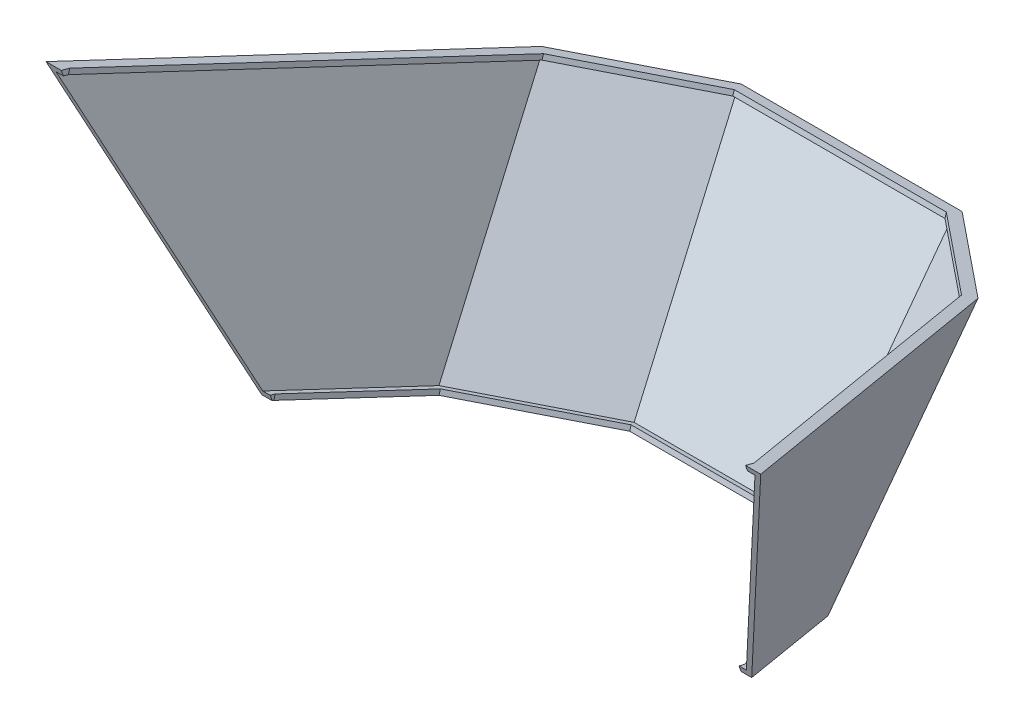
ISO-10303-21;
HEADER;
FILE_DESCRIPTION(('STEP AP214'),'2;1');
FILE_NAME('part.step','',(''),(''),'','','');
FILE_SCHEMA(('AUTOMOTIVE_DESIGN { 1 0 10303 214 1 1 1 1 }'));
ENDSEC;
DATA;
#1=APPLICATION_CONTEXT('core data for automotive mechanical design processes');
#2=APPLICATION_PROTOCOL_DEFINITION('international standard','automotive_design',2000,#1);
#3=PRODUCT_CONTEXT('',#1,'mechanical');
#4=PRODUCT('Part','Part','',(#3));
#5=PRODUCT_RELATED_PRODUCT_CATEGORY('part','',(#4));
#6=PRODUCT_DEFINITION_FORMATION('','',#4);
#7=PRODUCT_DEFINITION_CONTEXT('part definition',#1,'design');
#8=PRODUCT_DEFINITION('design','',#6,#7);
#9=PRODUCT_DEFINITION_SHAPE('','',#8);
#10=(LENGTH_UNIT() NAMED_UNIT(*) SI_UNIT(.MILLI.,.METRE.));
#11=(NAMED_UNIT(*) PLANE_ANGLE_UNIT() SI_UNIT($,.RADIAN.));
#12=(NAMED_UNIT(*) SI_UNIT($,.STERADIAN.) SOLID_ANGLE_UNIT());
#13=UNCERTAINTY_MEASURE_WITH_UNIT(LENGTH_MEASURE(1.E-05),#10,'distance_accuracy_value','');
#14=(GEOMETRIC_REPRESENTATION_CONTEXT(3) GLOBAL_UNCERTAINTY_ASSIGNED_CONTEXT((#13)) GLOBAL_UNIT_ASSIGNED_CONTEXT((#10,
#11,#12)) REPRESENTATION_CONTEXT('',''));
#15=CARTESIAN_POINT('',(0.,0.,0.));
#16=DIRECTION('',(0.,0.,1.));
#17=DIRECTION('',(1.,0.,0.));
#18=AXIS2_PLACEMENT_3D('',#15,#16,#17);
#19=CARTESIAN_POINT('',(87.7094880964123,205.750801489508,-511.611203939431));
#20=DIRECTION('',(-1.,0.,0.));
#21=DIRECTION('',(0.,0.,1.));
#22=AXIS2_PLACEMENT_3D('',#19,#20,#21);
#23=PLANE('',#22);
#24=DIRECTION('',(0.,0.939692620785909,0.342020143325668));
#25=VECTOR('',#24,1.);
#26=CARTESIAN_POINT('',(87.7094880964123,206.872048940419,-514.691805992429));
#27=LINE('',#26,#25);
#28=CARTESIAN_POINT('',(87.7094880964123,212.7450582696,-512.554205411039));
#29=VERTEX_POINT('',#28);
#30=CARTESIAN_POINT('',(87.7094880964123,216.186516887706,-511.30161691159));
#31=VERTEX_POINT('',#30);
#32=EDGE_CURVE('E453',#29,#31,#27,.T.);
#33=ORIENTED_EDGE('',*,*,#32,.F.);
#34=DIRECTION('',(0.,0.258819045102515,0.96592582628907));
#35=VECTOR('',#34,1.);
#36=CARTESIAN_POINT('',(87.7094880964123,213.692937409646,-509.016672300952));
#37=LINE('',#36,#35);
#38=CARTESIAN_POINT('',(87.7094880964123,212.512282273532,-513.422937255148));
#39=VERTEX_POINT('',#38);
#40=EDGE_CURVE('E306',#39,#29,#37,.T.);
#41=ORIENTED_EDGE('',*,*,#40,.F.);
#42=DIRECTION('',(0.,0.96592582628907,-0.258819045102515));
#43=VECTOR('',#42,1.);
#44=CARTESIAN_POINT('',(87.7094880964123,205.750801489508,-511.611203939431));
#45=LINE('',#44,#43);
#46=CARTESIAN_POINT('',(87.7094880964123,215.410059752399,-514.199394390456));
#47=VERTEX_POINT('',#46);
#48=EDGE_CURVE('E293',#39,#47,#45,.T.);
#49=ORIENTED_EDGE('',*,*,#48,.T.);
#50=DIRECTION('',(0.,0.258819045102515,0.96592582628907));
#51=VECTOR('',#50,1.);
#52=CARTESIAN_POINT('',(87.7094880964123,215.410059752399,-514.199394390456));
#53=LINE('',#52,#51);
#54=EDGE_CURVE('E289',#47,#31,#53,.T.);
#55=ORIENTED_EDGE('',*,*,#54,.T.);
#56=EDGE_LOOP('',(#33,#41,#49,#55));
#57=FACE_BOUND('',#56,.T.);
#58=ADVANCED_FACE('F33',(#57),#23,.F.);
#59=CARTESIAN_POINT('',(362.290511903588,220.28562900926,-457.366489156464));
#60=DIRECTION('',(1.,0.,0.));
#61=DIRECTION('',(0.,0.,-1.));
#62=AXIS2_PLACEMENT_3D('',#59,#60,#61);
#63=PLANE('',#62);
#64=DIRECTION('',(0.,-0.939692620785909,-0.342020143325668));
#65=VECTOR('',#64,1.);
#66=CARTESIAN_POINT('',(362.290511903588,237.14053990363,-503.674976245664));
#67=LINE('',#66,#65);
#68=CARTESIAN_POINT('',(362.290511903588,216.186516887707,-511.301616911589));
#69=VERTEX_POINT('',#68);
#70=CARTESIAN_POINT('',(362.290511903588,212.7450582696,-512.554205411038));
#71=VERTEX_POINT('',#70);
#72=EDGE_CURVE('E447',#69,#71,#67,.T.);
#73=ORIENTED_EDGE('',*,*,#72,.F.);
#74=DIRECTION('',(0.,-0.258819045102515,-0.96592582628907));
#75=VECTOR('',#74,1.);
#76=CARTESIAN_POINT('',(362.290511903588,229.944887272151,-459.954679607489));
#77=LINE('',#76,#75);
#78=CARTESIAN_POINT('',(362.290511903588,215.410059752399,-514.199394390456));
#79=VERTEX_POINT('',#78);
#80=EDGE_CURVE('E265',#69,#79,#77,.T.);
#81=ORIENTED_EDGE('',*,*,#80,.T.);
#82=DIRECTION('',(0.,0.96592582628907,-0.258819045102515));
#83=VECTOR('',#82,1.);
#84=CARTESIAN_POINT('',(362.290511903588,205.750801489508,-511.611203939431));
#85=LINE('',#84,#83);
#86=CARTESIAN_POINT('',(362.290511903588,212.512282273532,-513.422937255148));
#87=VERTEX_POINT('',#86);
#88=EDGE_CURVE('E292',#87,#79,#85,.T.);
#89=ORIENTED_EDGE('',*,*,#88,.F.);
#90=DIRECTION('',(0.,-0.258819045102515,-0.96592582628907));
#91=VECTOR('',#90,1.);
#92=CARTESIAN_POINT('',(362.290511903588,213.692937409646,-509.016672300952));
#93=LINE('',#92,#91);
#94=EDGE_CURVE('E295',#71,#87,#93,.T.);
#95=ORIENTED_EDGE('',*,*,#94,.F.);
#96=EDGE_LOOP('',(#73,#81,#89,#95));
#97=FACE_BOUND('',#96,.T.);
#98=ADVANCED_FACE('F504',(#97),#63,.F.);
#99=CARTESIAN_POINT('',(450.,213.692937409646,-509.016672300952));
#100=DIRECTION('',(0.,0.96592582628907,-0.258819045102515));
#101=DIRECTION('',(0.,0.258819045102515,0.96592582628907));
#102=AXIS2_PLACEMENT_3D('',#99,#100,#101);
#103=PLANE('',#102);
#104=DIRECTION('',(1.,0.,0.));
#105=VECTOR('',#104,1.);
#106=CARTESIAN_POINT('',(450.,212.7450582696,-512.554205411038));
#107=LINE('',#106,#105);
#108=CARTESIAN_POINT('',(81.4768604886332,212.7450582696,-512.55420541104));
#109=VERTEX_POINT('',#108);
#110=EDGE_CURVE('E255',#109,#29,#107,.T.);
#111=ORIENTED_EDGE('',*,*,#110,.F.);
#112=DIRECTION('',(-0.352911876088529,0.242165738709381,0.90377484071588));
#113=VECTOR('',#112,1.);
#114=CARTESIAN_POINT('',(126.165920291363,182.079728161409,-626.998775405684));
#115=LINE('',#114,#113);
#116=CARTESIAN_POINT('',(110.068113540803,193.125934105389,-585.77377359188));
#117=VERTEX_POINT('',#116);
#118=EDGE_CURVE('E339',#117,#109,#115,.T.);
#119=ORIENTED_EDGE('',*,*,#118,.F.);
#120=DIRECTION('',(-0.749794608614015,0.171252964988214,0.639124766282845));
#121=VECTOR('',#120,1.);
#122=CARTESIAN_POINT('',(261.751241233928,158.481532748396,-715.06843965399));
#123=LINE('',#122,#121);
#124=CARTESIAN_POINT('',(173.168846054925,178.713737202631,-639.56082468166));
#125=VERTEX_POINT('',#124);
#126=EDGE_CURVE('E337',#125,#117,#123,.T.);
#127=ORIENTED_EDGE('',*,*,#126,.F.);
#128=DIRECTION('',(-1.,0.,0.));
#129=VECTOR('',#128,1.);
#130=CARTESIAN_POINT('',(450.,178.713737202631,-639.56082468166));
#131=LINE('',#130,#129);
#132=CARTESIAN_POINT('',(276.831153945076,178.713737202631,-639.56082468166));
#133=VERTEX_POINT('',#132);
#134=EDGE_CURVE('E325',#133,#125,#131,.T.);
#135=ORIENTED_EDGE('',*,*,#134,.F.);
#136=DIRECTION('',(-0.749794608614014,-0.171252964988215,-0.639124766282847));
#137=VECTOR('',#136,1.);
#138=CARTESIAN_POINT('',(441.235138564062,216.263580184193,-499.422902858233));
#139=LINE('',#138,#137);
#140=CARTESIAN_POINT('',(339.931886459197,193.125934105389,-585.77377359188));
#141=VERTEX_POINT('',#140);
#142=EDGE_CURVE('E331',#141,#133,#139,.T.);
#143=ORIENTED_EDGE('',*,*,#142,.F.);
#144=DIRECTION('',(-0.352911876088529,-0.242165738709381,-0.90377484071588));
#145=VECTOR('',#144,1.);
#146=CARTESIAN_POINT('',(379.880136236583,220.53815248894,-483.46998183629));
#147=LINE('',#146,#145);
#148=CARTESIAN_POINT('',(368.523139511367,212.7450582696,-512.554205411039));
#149=VERTEX_POINT('',#148);
#150=EDGE_CURVE('E342',#149,#141,#147,.T.);
#151=ORIENTED_EDGE('',*,*,#150,.F.);
#152=EDGE_CURVE('E449',#71,#149,#107,.T.);
#153=ORIENTED_EDGE('',*,*,#152,.F.);
#154=ORIENTED_EDGE('',*,*,#94,.T.);
#155=DIRECTION('',(-0.352911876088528,-0.242165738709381,-0.903774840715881));
#156=VECTOR('',#155,1.);
#157=CARTESIAN_POINT('',(374.72074069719,221.04182106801,-481.590265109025));
#158=LINE('',#157,#156);
#159=CARTESIAN_POINT('',(335.110043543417,193.861229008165,-583.029615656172));
#160=VERTEX_POINT('',#159);
#161=EDGE_CURVE('E309',#87,#160,#158,.T.);
#162=ORIENTED_EDGE('',*,*,#161,.T.);
#163=DIRECTION('',(-0.749794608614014,-0.171252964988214,-0.639124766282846));
#164=VECTOR('',#163,1.);
#165=CARTESIAN_POINT('',(437.714647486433,217.296103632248,-495.569472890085));
#166=LINE('',#165,#164);
#167=CARTESIAN_POINT('',(274.798099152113,180.085990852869,-634.439504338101));
#168=VERTEX_POINT('',#167);
#169=EDGE_CURVE('E312',#160,#168,#166,.T.);
#170=ORIENTED_EDGE('',*,*,#169,.T.);
#171=DIRECTION('',(-1.,0.,0.));
#172=VECTOR('',#171,1.);
#173=CARTESIAN_POINT('',(450.,180.085990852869,-634.439504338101));
#174=LINE('',#173,#172);
#175=CARTESIAN_POINT('',(175.201900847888,180.085990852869,-634.439504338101));
#176=VERTEX_POINT('',#175);
#177=EDGE_CURVE('E315',#168,#176,#174,.T.);
#178=ORIENTED_EDGE('',*,*,#177,.T.);
#179=DIRECTION('',(-0.749794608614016,0.171252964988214,0.639124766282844));
#180=VECTOR('',#179,1.);
#181=CARTESIAN_POINT('',(265.271732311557,159.514056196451,-711.215009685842));
#182=LINE('',#181,#180);
#183=CARTESIAN_POINT('',(114.889956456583,193.861229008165,-583.029615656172));
#184=VERTEX_POINT('',#183);
#185=EDGE_CURVE('E318',#176,#184,#182,.T.);
#186=ORIENTED_EDGE('',*,*,#185,.T.);
#187=DIRECTION('',(-0.352911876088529,0.242165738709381,0.90377484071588));
#188=VECTOR('',#187,1.);
#189=CARTESIAN_POINT('',(131.325315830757,182.583396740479,-625.119058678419));
#190=LINE('',#189,#188);
#191=EDGE_CURVE('E321',#184,#39,#190,.T.);
#192=ORIENTED_EDGE('',*,*,#191,.T.);
#193=ORIENTED_EDGE('',*,*,#40,.T.);
#194=EDGE_LOOP('',(#111,#119,#127,#135,#143,#151,#153,#154,#162,#170,#178,#186,#192,#193));
#195=FACE_BOUND('',#194,.T.);
#196=ADVANCED_FACE('F470',(#195),#103,.F.);
#197=CARTESIAN_POINT('',(450.,303.358196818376,-734.618347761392));
#198=DIRECTION('',(0.,-0.96592582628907,0.258819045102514));
#199=DIRECTION('',(0.,-0.258819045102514,-0.96592582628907));
#200=AXIS2_PLACEMENT_3D('',#197,#198,#199);
#201=PLANE('',#200);
#202=DIRECTION('',(-1.,0.,0.));
#203=VECTOR('',#202,1.);
#204=CARTESIAN_POINT('',(449.999999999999,379.082224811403,-452.012427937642));
#205=LINE('',#204,#203);
#206=CARTESIAN_POINT('',(434.337984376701,379.082224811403,-452.012427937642));
#207=VERTEX_POINT('',#206);
#208=CARTESIAN_POINT('',(425.381983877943,379.082224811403,-452.012427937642));
#209=VERTEX_POINT('',#208);
#210=EDGE_CURVE('E257',#207,#209,#205,.T.);
#211=ORIENTED_EDGE('',*,*,#210,.F.);
#212=DIRECTION('',(0.352911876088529,0.24216573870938,0.90377484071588));
#213=VECTOR('',#212,1.);
#214=CARTESIAN_POINT('',(339.67905256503,314.127907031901,-694.425242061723));
#215=LINE('',#214,#213);
#216=CARTESIAN_POINT('',(352.797034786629,323.129377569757,-660.831296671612));
#217=VERTEX_POINT('',#216);
#218=EDGE_CURVE('E344',#217,#207,#215,.T.);
#219=ORIENTED_EDGE('',*,*,#218,.F.);
#220=DIRECTION('',(0.749794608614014,0.171252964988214,0.639124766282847));
#221=VECTOR('',#220,1.);
#222=CARTESIAN_POINT('',(369.545387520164,326.954698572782,-646.55500433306));
#223=LINE('',#222,#221);
#224=CARTESIAN_POINT('',(289.696302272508,308.717180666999,-714.618347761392));
#225=VERTEX_POINT('',#224);
#226=EDGE_CURVE('E93',#225,#217,#223,.T.);
#227=ORIENTED_EDGE('',*,*,#226,.F.);
#228=DIRECTION('',(1.,0.,0.));
#229=VECTOR('',#228,1.);
#230=CARTESIAN_POINT('',(450.,308.717180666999,-714.618347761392));
#231=LINE('',#230,#229);
#232=CARTESIAN_POINT('',(160.303697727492,308.717180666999,-714.618347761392));
#233=VERTEX_POINT('',#232);
#234=EDGE_CURVE('E86',#233,#225,#231,.T.);
#235=ORIENTED_EDGE('',*,*,#234,.F.);
#236=DIRECTION('',(0.749794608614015,-0.171252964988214,-0.639124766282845));
#237=VECTOR('',#236,1.);
#238=CARTESIAN_POINT('',(333.440992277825,269.172651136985,-862.200541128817));
#239=LINE('',#238,#237);
#240=CARTESIAN_POINT('',(97.2029652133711,323.129377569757,-660.831296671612));
#241=VERTEX_POINT('',#240);
#242=EDGE_CURVE('E334',#241,#233,#239,.T.);
#243=ORIENTED_EDGE('',*,*,#242,.F.);
#244=DIRECTION('',(0.352911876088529,-0.24216573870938,-0.90377484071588));
#245=VECTOR('',#244,1.);
#246=CARTESIAN_POINT('',(166.367003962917,275.66948270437,-837.954035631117));
#247=LINE('',#246,#245);
#248=CARTESIAN_POINT('',(15.6620156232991,379.082224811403,-452.012427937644));
#249=VERTEX_POINT('',#248);
#250=EDGE_CURVE('E254',#249,#241,#247,.T.);
#251=ORIENTED_EDGE('',*,*,#250,.F.);
#252=CARTESIAN_POINT('',(24.6180161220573,379.082224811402,-452.012427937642));
#253=VERTEX_POINT('',#252);
#254=EDGE_CURVE('E235',#253,#249,#205,.T.);
#255=ORIENTED_EDGE('',*,*,#254,.F.);
#256=DIRECTION('',(0.,-0.258819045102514,-0.96592582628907));
#257=VECTOR('',#256,1.);
#258=CARTESIAN_POINT('',(24.6180161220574,303.358196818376,-734.618347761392));
#259=LINE('',#258,#257);
#260=CARTESIAN_POINT('',(24.6180161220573,377.762086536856,-456.939251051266));
#261=VERTEX_POINT('',#260);
#262=EDGE_CURVE('E251',#253,#261,#259,.T.);
#263=ORIENTED_EDGE('',*,*,#262,.T.);
#264=DIRECTION('',(0.352911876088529,-0.24216573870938,-0.903774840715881));
#265=VECTOR('',#264,1.);
#266=CARTESIAN_POINT('',(172.523315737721,276.270471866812,-835.711113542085));
#267=LINE('',#266,#265);
#268=CARTESIAN_POINT('',(102.557159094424,324.280774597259,-656.534224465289));
#269=VERTEX_POINT('',#268);
#270=EDGE_CURVE('E358',#261,#269,#267,.T.);
#271=ORIENTED_EDGE('',*,*,#270,.T.);
#272=DIRECTION('',(0.749794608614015,-0.171252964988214,-0.639124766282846));
#273=VECTOR('',#272,1.);
#274=CARTESIAN_POINT('',(337.992155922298,270.507460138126,-857.218966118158));
#275=LINE('',#274,#273);
#276=CARTESIAN_POINT('',(162.869103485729,310.505536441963,-707.944113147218));
#277=VERTEX_POINT('',#276);
#278=EDGE_CURVE('E399',#269,#277,#275,.T.);
#279=ORIENTED_EDGE('',*,*,#278,.T.);
#280=DIRECTION('',(1.,0.,0.));
#281=VECTOR('',#280,1.);
#282=CARTESIAN_POINT('',(450.,310.505536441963,-707.944113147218));
#283=LINE('',#282,#281);
#284=CARTESIAN_POINT('',(287.130896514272,310.505536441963,-707.944113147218));
#285=VERTEX_POINT('',#284);
#286=EDGE_CURVE('E402',#277,#285,#283,.T.);
#287=ORIENTED_EDGE('',*,*,#286,.T.);
#288=DIRECTION('',(0.749794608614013,0.171252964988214,0.639124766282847));
#289=VECTOR('',#288,1.);
#290=CARTESIAN_POINT('',(364.994223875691,328.289507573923,-641.573429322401));
#291=LINE('',#290,#289);
#292=CARTESIAN_POINT('',(347.442840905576,324.280774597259,-656.534224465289));
#293=VERTEX_POINT('',#292);
#294=EDGE_CURVE('E42',#285,#293,#291,.T.);
#295=ORIENTED_EDGE('',*,*,#294,.T.);
#296=DIRECTION('',(0.352911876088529,0.24216573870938,0.903774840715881));
#297=VECTOR('',#296,1.);
#298=CARTESIAN_POINT('',(333.522740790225,314.728896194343,-692.182319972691));
#299=LINE('',#298,#297);
#300=CARTESIAN_POINT('',(425.381983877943,377.762086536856,-456.939251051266));
#301=VERTEX_POINT('',#300);
#302=EDGE_CURVE('E12',#293,#301,#299,.T.);
#303=ORIENTED_EDGE('',*,*,#302,.T.);
#304=DIRECTION('',(0.,0.258819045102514,0.96592582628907));
#305=VECTOR('',#304,1.);
#306=CARTESIAN_POINT('',(425.381983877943,303.358196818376,-734.618347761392));
#307=LINE('',#306,#305);
#308=EDGE_CURVE('E261',#301,#209,#307,.T.);
#309=ORIENTED_EDGE('',*,*,#308,.T.);
#310=EDGE_LOOP('',(#211,#219,#227,#235,#243,#251,#255,#263,#271,#279,#287,#295,#303,#309));
#311=FACE_BOUND('',#310,.T.);
#312=ADVANCED_FACE('F249',(#311),#201,.F.);
#313=CARTESIAN_POINT('',(399.15129229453,-112.139629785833,-125.815468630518));
#314=DIRECTION('',(0.921243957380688,-0.258819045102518,-0.290382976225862));
#315=DIRECTION('',(-0.300626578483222,0.,-0.953741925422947));
#316=AXIS2_PLACEMENT_3D('',#313,#314,#315);
#317=PLANE('',#316);
#318=ORIENTED_EDGE('',*,*,#218,.T.);
#319=DIRECTION('',(-0.348500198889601,-0.880782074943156,-0.320578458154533));
#320=VECTOR('',#319,1.);
#321=CARTESIAN_POINT('',(315.725852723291,79.3078207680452,-561.121388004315));
#322=LINE('',#321,#320);
#323=EDGE_CURVE('E450',#207,#149,#322,.T.);
#324=ORIENTED_EDGE('',*,*,#323,.T.);
#325=ORIENTED_EDGE('',*,*,#150,.T.);
#326=DIRECTION('',(0.0853889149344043,0.862862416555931,-0.498173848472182));
#327=VECTOR('',#326,1.);
#328=CARTESIAN_POINT('',(298.306096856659,-227.506292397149,-342.921644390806));
#329=LINE('',#328,#327);
#330=EDGE_CURVE('E351',#141,#217,#329,.T.);
#331=ORIENTED_EDGE('',*,*,#330,.T.);
#332=EDGE_LOOP('',(#318,#324,#325,#331));
#333=FACE_BOUND('',#332,.T.);
#334=ADVANCED_FACE('F463',(#333),#317,.T.);
#335=CARTESIAN_POINT('',(-17.2405992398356,-4.84366317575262,-5.43436565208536));
#336=DIRECTION('',(-0.921243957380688,-0.258819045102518,-0.290382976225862));
#337=DIRECTION('',(-0.300626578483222,0.,0.953741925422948));
#338=AXIS2_PLACEMENT_3D('',#335,#336,#337);
#339=PLANE('',#338);
#340=ORIENTED_EDGE('',*,*,#118,.T.);
#341=DIRECTION('',(-0.348500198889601,0.880782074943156,0.320578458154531));
#342=VECTOR('',#341,1.);
#343=CARTESIAN_POINT('',(79.6205723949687,217.436548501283,-510.846642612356));
#344=LINE('',#343,#342);
#345=EDGE_CURVE('E243',#109,#249,#344,.T.);
#346=ORIENTED_EDGE('',*,*,#345,.T.);
#347=ORIENTED_EDGE('',*,*,#250,.T.);
#348=DIRECTION('',(0.0853889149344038,-0.86286241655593,0.498173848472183));
#349=VECTOR('',#348,1.);
#350=CARTESIAN_POINT('',(148.412833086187,-194.350793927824,-362.063980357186));
#351=LINE('',#350,#349);
#352=EDGE_CURVE('E348',#241,#117,#351,.T.);
#353=ORIENTED_EDGE('',*,*,#352,.T.);
#354=EDGE_LOOP('',(#340,#346,#347,#353));
#355=FACE_BOUND('',#354,.T.);
#356=ADVANCED_FACE('F479',(#355),#339,.T.);
#357=CARTESIAN_POINT('',(425.381983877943,428.105569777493,-296.100736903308));
#358=DIRECTION('',(1.,0.,0.));
#359=DIRECTION('',(0.,0.,-1.));
#360=AXIS2_PLACEMENT_3D('',#357,#358,#359);
#361=PLANE('',#360);
#362=DIRECTION('',(0.,-0.939692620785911,-0.342020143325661));
#363=VECTOR('',#362,1.);
#364=CARTESIAN_POINT('',(425.381983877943,381.056164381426,-451.293972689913));
#365=LINE('',#364,#363);
#366=CARTESIAN_POINT('',(425.381983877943,375.640766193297,-453.265016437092));
#367=VERTEX_POINT('',#366);
#368=EDGE_CURVE('E244',#209,#367,#365,.T.);
#369=ORIENTED_EDGE('',*,*,#368,.F.);
#370=ORIENTED_EDGE('',*,*,#308,.F.);
#371=DIRECTION('',(0.,-0.96592582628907,0.258819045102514));
#372=VECTOR('',#371,1.);
#373=CARTESIAN_POINT('',(425.381983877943,384.52356732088,-458.750984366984));
#374=LINE('',#373,#372);
#375=CARTESIAN_POINT('',(425.381983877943,374.864309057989,-456.162793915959));
#376=VERTEX_POINT('',#375);
#377=EDGE_CURVE('E262',#301,#376,#374,.T.);
#378=ORIENTED_EDGE('',*,*,#377,.T.);
#379=DIRECTION('',(0.,0.258819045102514,0.96592582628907));
#380=VECTOR('',#379,1.);
#381=CARTESIAN_POINT('',(425.381983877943,418.446311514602,-293.512546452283));
#382=LINE('',#381,#380);
#383=EDGE_CURVE('E427',#376,#367,#382,.T.);
#384=ORIENTED_EDGE('',*,*,#383,.T.);
#385=EDGE_LOOP('',(#369,#370,#378,#384));
#386=FACE_BOUND('',#385,.T.);
#387=ADVANCED_FACE('F459',(#386),#361,.F.);
#388=CARTESIAN_POINT('',(24.6180161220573,384.52356732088,-458.750984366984));
#389=DIRECTION('',(-1.,0.,0.));
#390=DIRECTION('',(0.,0.,1.));
#391=AXIS2_PLACEMENT_3D('',#388,#389,#390);
#392=PLANE('',#391);
#393=DIRECTION('',(0.,0.939692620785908,0.34202014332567));
#394=VECTOR('',#393,1.);
#395=CARTESIAN_POINT('',(24.6180161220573,377.61470576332,-452.546561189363));
#396=LINE('',#395,#394);
#397=CARTESIAN_POINT('',(24.6180161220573,375.640766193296,-453.265016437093));
#398=VERTEX_POINT('',#397);
#399=EDGE_CURVE('E232',#398,#253,#396,.T.);
#400=ORIENTED_EDGE('',*,*,#399,.F.);
#401=DIRECTION('',(0.,-0.258819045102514,-0.96592582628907));
#402=VECTOR('',#401,1.);
#403=CARTESIAN_POINT('',(24.6180161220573,374.864309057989,-456.162793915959));
#404=LINE('',#403,#402);
#405=CARTESIAN_POINT('',(24.6180161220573,374.864309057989,-456.162793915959));
#406=VERTEX_POINT('',#405);
#407=EDGE_CURVE('E445',#398,#406,#404,.T.);
#408=ORIENTED_EDGE('',*,*,#407,.T.);
#409=DIRECTION('',(0.,-0.96592582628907,0.258819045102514));
#410=VECTOR('',#409,1.);
#411=CARTESIAN_POINT('',(24.6180161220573,384.52356732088,-458.750984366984));
#412=LINE('',#411,#410);
#413=EDGE_CURVE('E260',#261,#406,#412,.T.);
#414=ORIENTED_EDGE('',*,*,#413,.F.);
#415=ORIENTED_EDGE('',*,*,#262,.F.);
#416=EDGE_LOOP('',(#400,#408,#414,#415));
#417=FACE_BOUND('',#416,.T.);
#418=ADVANCED_FACE('F259',(#417),#392,.F.);
#419=CARTESIAN_POINT('',(450.,216.590714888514,-509.793129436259));
#420=DIRECTION('',(0.,0.96592582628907,-0.258819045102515));
#421=DIRECTION('',(0.,0.258819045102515,0.96592582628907));
#422=AXIS2_PLACEMENT_3D('',#419,#420,#421);
#423=PLANE('',#422);
#424=ORIENTED_EDGE('',*,*,#54,.F.);
#425=DIRECTION('',(-0.352911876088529,0.242165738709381,0.90377484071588));
#426=VECTOR('',#425,1.);
#427=CARTESIAN_POINT('',(114.889956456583,196.759006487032,-583.80607279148));
#428=LINE('',#427,#426);
#429=CARTESIAN_POINT('',(114.889956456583,196.759006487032,-583.80607279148));
#430=VERTEX_POINT('',#429);
#431=EDGE_CURVE('E286',#430,#47,#428,.T.);
#432=ORIENTED_EDGE('',*,*,#431,.F.);
#433=DIRECTION('',(-0.749794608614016,0.171252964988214,0.639124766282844));
#434=VECTOR('',#433,1.);
#435=CARTESIAN_POINT('',(175.201900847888,182.983768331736,-635.215961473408));
#436=LINE('',#435,#434);
#437=CARTESIAN_POINT('',(175.201900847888,182.983768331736,-635.215961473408));
#438=VERTEX_POINT('',#437);
#439=EDGE_CURVE('E283',#438,#430,#436,.T.);
#440=ORIENTED_EDGE('',*,*,#439,.F.);
#441=DIRECTION('',(-1.,0.,0.));
#442=VECTOR('',#441,1.);
#443=CARTESIAN_POINT('',(274.798099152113,182.983768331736,-635.215961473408));
#444=LINE('',#443,#442);
#445=CARTESIAN_POINT('',(274.798099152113,182.983768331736,-635.215961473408));
#446=VERTEX_POINT('',#445);
#447=EDGE_CURVE('E280',#446,#438,#444,.T.);
#448=ORIENTED_EDGE('',*,*,#447,.F.);
#449=DIRECTION('',(-0.749794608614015,-0.171252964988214,-0.639124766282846));
#450=VECTOR('',#449,1.);
#451=CARTESIAN_POINT('',(335.110043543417,196.759006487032,-583.80607279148));
#452=LINE('',#451,#450);
#453=CARTESIAN_POINT('',(335.110043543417,196.759006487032,-583.80607279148));
#454=VERTEX_POINT('',#453);
#455=EDGE_CURVE('E277',#454,#446,#452,.T.);
#456=ORIENTED_EDGE('',*,*,#455,.F.);
#457=DIRECTION('',(-0.352911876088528,-0.242165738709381,-0.90377484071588));
#458=VECTOR('',#457,1.);
#459=CARTESIAN_POINT('',(362.290511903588,215.410059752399,-514.199394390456));
#460=LINE('',#459,#458);
#461=EDGE_CURVE('E274',#79,#454,#460,.T.);
#462=ORIENTED_EDGE('',*,*,#461,.F.);
#463=ORIENTED_EDGE('',*,*,#80,.F.);
#464=DIRECTION('',(-1.,0.,0.));
#465=VECTOR('',#464,1.);
#466=CARTESIAN_POINT('',(450.,216.186516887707,-511.301616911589));
#467=LINE('',#466,#465);
#468=CARTESIAN_POINT('',(366.628359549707,216.186516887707,-511.301616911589));
#469=VERTEX_POINT('',#468);
#470=EDGE_CURVE('E396',#469,#69,#467,.T.);
#471=ORIENTED_EDGE('',*,*,#470,.F.);
#472=DIRECTION('',(-0.352911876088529,-0.242165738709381,-0.90377484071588));
#473=VECTOR('',#472,1.);
#474=CARTESIAN_POINT('',(377.527710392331,223.665577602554,-483.389382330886));
#475=LINE('',#474,#473);
#476=CARTESIAN_POINT('',(337.653952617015,196.304475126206,-585.502406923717));
#477=VERTEX_POINT('',#476);
#478=EDGE_CURVE('E380',#469,#477,#475,.T.);
#479=ORIENTED_EDGE('',*,*,#478,.T.);
#480=DIRECTION('',(-0.749794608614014,-0.171252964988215,-0.639124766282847));
#481=VECTOR('',#480,1.);
#482=CARTESIAN_POINT('',(439.699659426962,219.611697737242,-498.51866795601));
#483=LINE('',#482,#481);
#484=CARTESIAN_POINT('',(275.932524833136,182.207311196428,-638.113738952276));
#485=VERTEX_POINT('',#484);
#486=EDGE_CURVE('E388',#477,#485,#483,.T.);
#487=ORIENTED_EDGE('',*,*,#486,.T.);
#488=DIRECTION('',(-1.,0.,0.));
#489=VECTOR('',#488,1.);
#490=CARTESIAN_POINT('',(450.,182.207311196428,-638.113738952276));
#491=LINE('',#490,#489);
#492=CARTESIAN_POINT('',(174.067475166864,182.207311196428,-638.113738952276));
#493=VERTEX_POINT('',#492);
#494=EDGE_CURVE('E356',#485,#493,#491,.T.);
#495=ORIENTED_EDGE('',*,*,#494,.T.);
#496=DIRECTION('',(-0.749794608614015,0.171252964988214,0.639124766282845));
#497=VECTOR('',#496,1.);
#498=CARTESIAN_POINT('',(263.286720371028,161.829650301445,-714.164204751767));
#499=LINE('',#498,#497);
#500=CARTESIAN_POINT('',(112.346047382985,196.304475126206,-585.502406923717));
#501=VERTEX_POINT('',#500);
#502=EDGE_CURVE('E79',#493,#501,#499,.T.);
#503=ORIENTED_EDGE('',*,*,#502,.T.);
#504=DIRECTION('',(-0.352911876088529,0.242165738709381,0.90377484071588));
#505=VECTOR('',#504,1.);
#506=CARTESIAN_POINT('',(128.518346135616,185.207153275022,-626.91817590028));
#507=LINE('',#506,#505);
#508=CARTESIAN_POINT('',(83.3716404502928,216.186516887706,-511.30161691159));
#509=VERTEX_POINT('',#508);
#510=EDGE_CURVE('E366',#501,#509,#507,.T.);
#511=ORIENTED_EDGE('',*,*,#510,.T.);
#512=EDGE_CURVE('E355',#31,#509,#467,.T.);
#513=ORIENTED_EDGE('',*,*,#512,.F.);
#514=EDGE_LOOP('',(#424,#432,#440,#448,#456,#462,#463,#471,#479,#487,#495,#503,#511,#513));
#515=FACE_BOUND('',#514,.T.);
#516=ADVANCED_FACE('F486',(#515),#423,.T.);
#517=CARTESIAN_POINT('',(450.,300.460419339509,-733.841890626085));
#518=DIRECTION('',(0.,-0.96592582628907,0.258819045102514));
#519=DIRECTION('',(0.,-0.258819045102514,-0.96592582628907));
#520=AXIS2_PLACEMENT_3D('',#517,#518,#519);
#521=PLANE('',#520);
#522=ORIENTED_EDGE('',*,*,#383,.F.);
#523=DIRECTION('',(0.352911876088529,0.24216573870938,0.903774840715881));
#524=VECTOR('',#523,1.);
#525=CARTESIAN_POINT('',(347.442840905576,321.382997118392,-655.757767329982));
#526=LINE('',#525,#524);
#527=CARTESIAN_POINT('',(347.442840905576,321.382997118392,-655.757767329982));
#528=VERTEX_POINT('',#527);
#529=EDGE_CURVE('E430',#528,#376,#526,.T.);
#530=ORIENTED_EDGE('',*,*,#529,.F.);
#531=DIRECTION('',(0.749794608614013,0.171252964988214,0.639124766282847));
#532=VECTOR('',#531,1.);
#533=CARTESIAN_POINT('',(287.130896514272,307.607758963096,-707.16765601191));
#534=LINE('',#533,#532);
#535=CARTESIAN_POINT('',(287.130896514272,307.607758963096,-707.16765601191));
#536=VERTEX_POINT('',#535);
#537=EDGE_CURVE('E436',#536,#528,#534,.T.);
#538=ORIENTED_EDGE('',*,*,#537,.F.);
#539=DIRECTION('',(1.,0.,0.));
#540=VECTOR('',#539,1.);
#541=CARTESIAN_POINT('',(162.869103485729,307.607758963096,-707.16765601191));
#542=LINE('',#541,#540);
#543=CARTESIAN_POINT('',(162.869103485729,307.607758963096,-707.16765601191));
#544=VERTEX_POINT('',#543);
#545=EDGE_CURVE('E416',#544,#536,#542,.T.);
#546=ORIENTED_EDGE('',*,*,#545,.F.);
#547=DIRECTION('',(0.749794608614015,-0.171252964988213,-0.639124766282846));
#548=VECTOR('',#547,1.);
#549=CARTESIAN_POINT('',(102.557159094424,321.382997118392,-655.757767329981));
#550=LINE('',#549,#548);
#551=CARTESIAN_POINT('',(102.557159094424,321.382997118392,-655.757767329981));
#552=VERTEX_POINT('',#551);
#553=EDGE_CURVE('E441',#552,#544,#550,.T.);
#554=ORIENTED_EDGE('',*,*,#553,.F.);
#555=DIRECTION('',(0.352911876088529,-0.24216573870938,-0.90377484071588));
#556=VECTOR('',#555,1.);
#557=CARTESIAN_POINT('',(24.6180161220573,374.864309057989,-456.162793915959));
#558=LINE('',#557,#556);
#559=EDGE_CURVE('E443',#406,#552,#558,.T.);
#560=ORIENTED_EDGE('',*,*,#559,.F.);
#561=ORIENTED_EDGE('',*,*,#407,.F.);
#562=DIRECTION('',(-1.,0.,0.));
#563=VECTOR('',#562,1.);
#564=CARTESIAN_POINT('',(450.,375.640766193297,-453.265016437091));
#565=LINE('',#564,#563);
#566=CARTESIAN_POINT('',(20.2801684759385,375.640766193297,-453.265016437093));
#567=VERTEX_POINT('',#566);
#568=EDGE_CURVE('E238',#398,#567,#565,.T.);
#569=ORIENTED_EDGE('',*,*,#568,.T.);
#570=DIRECTION('',(0.352911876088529,-0.24216573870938,-0.90377484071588));
#571=VECTOR('',#570,1.);
#572=CARTESIAN_POINT('',(169.71634604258,273.098673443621,-835.957316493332));
#573=LINE('',#572,#571);
#574=CARTESIAN_POINT('',(100.013250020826,320.928465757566,-657.454101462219));
#575=VERTEX_POINT('',#574);
#576=EDGE_CURVE('E369',#567,#575,#573,.T.);
#577=ORIENTED_EDGE('',*,*,#576,.T.);
#578=DIRECTION('',(0.749794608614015,-0.171252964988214,-0.639124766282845));
#579=VECTOR('',#578,1.);
#580=CARTESIAN_POINT('',(336.00714398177,267.027499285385,-858.615246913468));
#581=LINE('',#580,#579);
#582=CARTESIAN_POINT('',(161.734677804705,306.831301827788,-710.065433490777));
#583=VERTEX_POINT('',#582);
#584=EDGE_CURVE('E393',#575,#583,#581,.T.);
#585=ORIENTED_EDGE('',*,*,#584,.T.);
#586=DIRECTION('',(1.,0.,0.));
#587=VECTOR('',#586,1.);
#588=CARTESIAN_POINT('',(450.,306.831301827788,-710.065433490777));
#589=LINE('',#588,#587);
#590=CARTESIAN_POINT('',(288.265322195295,306.831301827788,-710.065433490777));
#591=VERTEX_POINT('',#590);
#592=EDGE_CURVE('E359',#583,#591,#589,.T.);
#593=ORIENTED_EDGE('',*,*,#592,.T.);
#594=DIRECTION('',(0.749794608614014,0.171252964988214,0.639124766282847));
#595=VECTOR('',#594,1.);
#596=CARTESIAN_POINT('',(366.97923581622,324.809546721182,-642.969710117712));
#597=LINE('',#596,#595);
#598=CARTESIAN_POINT('',(349.986749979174,320.928465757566,-657.454101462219));
#599=VERTEX_POINT('',#598);
#600=EDGE_CURVE('E383',#591,#599,#597,.T.);
#601=ORIENTED_EDGE('',*,*,#600,.T.);
#602=DIRECTION('',(0.352911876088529,0.24216573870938,0.90377484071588));
#603=VECTOR('',#602,1.);
#604=CARTESIAN_POINT('',(336.329710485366,311.557097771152,-692.428522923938));
#605=LINE('',#604,#603);
#606=CARTESIAN_POINT('',(429.719831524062,375.640766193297,-453.265016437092));
#607=VERTEX_POINT('',#606);
#608=EDGE_CURVE('E374',#599,#607,#605,.T.);
#609=ORIENTED_EDGE('',*,*,#608,.T.);
#610=EDGE_CURVE('E361',#607,#367,#565,.T.);
#611=ORIENTED_EDGE('',*,*,#610,.T.);
#612=EDGE_LOOP('',(#522,#530,#538,#546,#554,#560,#561,#569,#577,#585,#593,#601,#609,#611));
#613=FACE_BOUND('',#612,.T.);
#614=ADVANCED_FACE('F489',(#613),#521,.T.);
#615=CARTESIAN_POINT('',(-138.265438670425,-92.9532467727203,-137.300517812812));
#616=DIRECTION('',(-0.640439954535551,-0.430555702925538,-0.635970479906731));
#617=DIRECTION('',(-0.704626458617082,0.,0.709578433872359));
#618=AXIS2_PLACEMENT_3D('',#615,#616,#617);
#619=PLANE('',#618);
#620=ORIENTED_EDGE('',*,*,#584,.F.);
#621=DIRECTION('',(0.0853889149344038,-0.86286241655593,0.498173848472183));
#622=VECTOR('',#621,1.);
#623=CARTESIAN_POINT('',(150.89680572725,-193.254292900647,-360.590547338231));
#624=LINE('',#623,#622);
#625=EDGE_CURVE('E75',#575,#501,#624,.T.);
#626=ORIENTED_EDGE('',*,*,#625,.T.);
#627=ORIENTED_EDGE('',*,*,#502,.F.);
#628=DIRECTION('',(0.0853889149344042,-0.86286241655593,0.498173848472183));
#629=VECTOR('',#628,1.);
#630=CARTESIAN_POINT('',(213.367551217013,-214.923377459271,-408.830228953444));
#631=LINE('',#630,#629);
#632=EDGE_CURVE('E50',#583,#493,#631,.T.);
#633=ORIENTED_EDGE('',*,*,#632,.F.);
#634=EDGE_LOOP('',(#620,#626,#627,#633));
#635=FACE_BOUND('',#634,.T.);
#636=ADVANCED_FACE('F552',(#635),#619,.F.);
#637=CARTESIAN_POINT('',(322.838939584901,-217.038530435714,-320.585925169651));
#638=DIRECTION('',(0.640439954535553,-0.430555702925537,-0.63597047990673));
#639=DIRECTION('',(-0.704626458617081,0.,-0.70957843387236));
#640=AXIS2_PLACEMENT_3D('',#637,#638,#639);
#641=PLANE('',#640);
#642=ORIENTED_EDGE('',*,*,#486,.F.);
#643=DIRECTION('',(0.0853889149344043,0.862862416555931,-0.498173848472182));
#644=VECTOR('',#643,1.);
#645=CARTESIAN_POINT('',(295.822124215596,-226.409791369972,-341.448211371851));
#646=LINE('',#645,#644);
#647=EDGE_CURVE('E377',#477,#599,#646,.T.);
#648=ORIENTED_EDGE('',*,*,#647,.T.);
#649=ORIENTED_EDGE('',*,*,#600,.F.);
#650=DIRECTION('',(0.0853889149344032,0.86286241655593,-0.498173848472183));
#651=VECTOR('',#650,1.);
#652=CARTESIAN_POINT('',(233.351378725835,-248.078875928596,-389.687892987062));
#653=LINE('',#652,#651);
#654=EDGE_CURVE('E385',#485,#591,#653,.T.);
#655=ORIENTED_EDGE('',*,*,#654,.F.);
#656=EDGE_LOOP('',(#642,#648,#649,#655));
#657=FACE_BOUND('',#656,.T.);
#658=ADVANCED_FACE('F500',(#657),#641,.F.);
#659=CARTESIAN_POINT('',(396.387560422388,-111.363172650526,-124.944319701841));
#660=DIRECTION('',(0.921243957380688,-0.258819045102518,-0.290382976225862));
#661=DIRECTION('',(-0.300626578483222,0.,-0.953741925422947));
#662=AXIS2_PLACEMENT_3D('',#659,#660,#661);
#663=PLANE('',#662);
#664=ORIENTED_EDGE('',*,*,#478,.F.);
#665=DIRECTION('',(-0.348500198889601,-0.880782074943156,-0.320578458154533));
#666=VECTOR('',#665,1.);
#667=CARTESIAN_POINT('',(434.065385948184,386.62350438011,-449.267626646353));
#668=LINE('',#667,#666);
#669=EDGE_CURVE('E372',#607,#469,#668,.T.);
#670=ORIENTED_EDGE('',*,*,#669,.F.);
#671=ORIENTED_EDGE('',*,*,#608,.F.);
#672=ORIENTED_EDGE('',*,*,#647,.F.);
#673=EDGE_LOOP('',(#664,#670,#671,#672));
#674=FACE_BOUND('',#673,.T.);
#675=ADVANCED_FACE('F493',(#674),#663,.F.);
#676=CARTESIAN_POINT('',(-14.4768673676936,-4.06720604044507,-4.56321672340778));
#677=DIRECTION('',(-0.921243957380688,-0.258819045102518,-0.290382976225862));
#678=DIRECTION('',(-0.300626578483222,0.,0.953741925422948));
#679=AXIS2_PLACEMENT_3D('',#676,#677,#678);
#680=PLANE('',#679);
#681=ORIENTED_EDGE('',*,*,#576,.F.);
#682=DIRECTION('',(-0.348500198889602,0.880782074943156,0.320578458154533));
#683=VECTOR('',#682,1.);
#684=CARTESIAN_POINT('',(70.5881889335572,248.494776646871,-499.542372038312));
#685=LINE('',#684,#683);
#686=EDGE_CURVE('E364',#509,#567,#685,.T.);
#687=ORIENTED_EDGE('',*,*,#686,.F.);
#688=ORIENTED_EDGE('',*,*,#510,.F.);
#689=ORIENTED_EDGE('',*,*,#625,.F.);
#690=EDGE_LOOP('',(#681,#687,#688,#689));
#691=FACE_BOUND('',#690,.T.);
#692=ADVANCED_FACE('F491',(#691),#680,.F.);
#693=CARTESIAN_POINT('',(0.,-230.759526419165,-399.687224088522));
#694=DIRECTION('',(0.,-0.500000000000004,-0.866025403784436));
#695=DIRECTION('',(0.,0.866025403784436,-0.500000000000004));
#696=AXIS2_PLACEMENT_3D('',#693,#694,#695);
#697=PLANE('',#696);
#698=ORIENTED_EDGE('',*,*,#592,.F.);
#699=ORIENTED_EDGE('',*,*,#632,.T.);
#700=ORIENTED_EDGE('',*,*,#494,.F.);
#701=ORIENTED_EDGE('',*,*,#654,.T.);
#702=EDGE_LOOP('',(#698,#699,#700,#701));
#703=FACE_BOUND('',#702,.T.);
#704=ADVANCED_FACE('F35',(#703),#697,.F.);
#705=CARTESIAN_POINT('',(114.889956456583,187.099748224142,-581.217882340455));
#706=DIRECTION('',(-0.935656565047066,-0.0913403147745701,-0.340886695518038));
#707=DIRECTION('',(-0.342317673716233,0.,0.939584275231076));
#708=AXIS2_PLACEMENT_3D('',#705,#706,#707);
#709=PLANE('',#708);
#710=DIRECTION('',(0.,0.96592582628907,-0.258819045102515));
#711=VECTOR('',#710,1.);
#712=CARTESIAN_POINT('',(114.889956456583,187.099748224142,-581.217882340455));
#713=LINE('',#712,#711);
#714=EDGE_CURVE('E296',#184,#430,#713,.T.);
#715=ORIENTED_EDGE('',*,*,#714,.T.);
#716=ORIENTED_EDGE('',*,*,#431,.T.);
#717=ORIENTED_EDGE('',*,*,#48,.F.);
#718=ORIENTED_EDGE('',*,*,#191,.F.);
#719=EDGE_LOOP('',(#715,#716,#717,#718));
#720=FACE_BOUND('',#719,.T.);
#721=ADVANCED_FACE('F498',(#720),#709,.F.);
#722=CARTESIAN_POINT('',(175.201900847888,173.324510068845,-632.627771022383));
#723=DIRECTION('',(-0.661670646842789,-0.194061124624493,-0.724245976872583));
#724=DIRECTION('',(-0.738281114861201,0.,0.674493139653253));
#725=AXIS2_PLACEMENT_3D('',#722,#723,#724);
#726=PLANE('',#725);
#727=DIRECTION('',(0.,0.96592582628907,-0.258819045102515));
#728=VECTOR('',#727,1.);
#729=CARTESIAN_POINT('',(175.201900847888,173.324510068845,-632.627771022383));
#730=LINE('',#729,#728);
#731=EDGE_CURVE('E298',#176,#438,#730,.T.);
#732=ORIENTED_EDGE('',*,*,#731,.T.);
#733=ORIENTED_EDGE('',*,*,#439,.T.);
#734=ORIENTED_EDGE('',*,*,#714,.F.);
#735=ORIENTED_EDGE('',*,*,#185,.F.);
#736=EDGE_LOOP('',(#732,#733,#734,#735));
#737=FACE_BOUND('',#736,.T.);
#738=ADVANCED_FACE('F516',(#737),#726,.F.);
#739=CARTESIAN_POINT('',(274.798099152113,173.324510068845,-632.627771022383));
#740=DIRECTION('',(0.,-0.258819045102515,-0.96592582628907));
#741=DIRECTION('',(0.,0.96592582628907,-0.258819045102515));
#742=AXIS2_PLACEMENT_3D('',#739,#740,#741);
#743=PLANE('',#742);
#744=DIRECTION('',(0.,0.96592582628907,-0.258819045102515));
#745=VECTOR('',#744,1.);
#746=CARTESIAN_POINT('',(274.798099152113,173.324510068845,-632.627771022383));
#747=LINE('',#746,#745);
#748=EDGE_CURVE('E300',#168,#446,#747,.T.);
#749=ORIENTED_EDGE('',*,*,#748,.T.);
#750=ORIENTED_EDGE('',*,*,#447,.T.);
#751=ORIENTED_EDGE('',*,*,#731,.F.);
#752=ORIENTED_EDGE('',*,*,#177,.F.);
#753=EDGE_LOOP('',(#749,#750,#751,#752));
#754=FACE_BOUND('',#753,.T.);
#755=ADVANCED_FACE('F520',(#754),#743,.F.);
#756=CARTESIAN_POINT('',(335.110043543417,187.099748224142,-581.217882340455));
#757=DIRECTION('',(0.661670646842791,-0.194061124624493,-0.724245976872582));
#758=DIRECTION('',(-0.738281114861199,0.,-0.674493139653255));
#759=AXIS2_PLACEMENT_3D('',#756,#757,#758);
#760=PLANE('',#759);
#761=DIRECTION('',(0.,0.96592582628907,-0.258819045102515));
#762=VECTOR('',#761,1.);
#763=CARTESIAN_POINT('',(335.110043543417,187.099748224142,-581.217882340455));
#764=LINE('',#763,#762);
#765=EDGE_CURVE('E302',#160,#454,#764,.T.);
#766=ORIENTED_EDGE('',*,*,#765,.T.);
#767=ORIENTED_EDGE('',*,*,#455,.T.);
#768=ORIENTED_EDGE('',*,*,#748,.F.);
#769=ORIENTED_EDGE('',*,*,#169,.F.);
#770=EDGE_LOOP('',(#766,#767,#768,#769));
#771=FACE_BOUND('',#770,.T.);
#772=ADVANCED_FACE('F524',(#771),#760,.F.);
#773=CARTESIAN_POINT('',(362.290511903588,205.750801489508,-511.611203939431));
#774=DIRECTION('',(0.935656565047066,-0.0913403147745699,-0.340886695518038));
#775=DIRECTION('',(-0.342317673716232,0.,-0.939584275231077));
#776=AXIS2_PLACEMENT_3D('',#773,#774,#775);
#777=PLANE('',#776);
#778=ORIENTED_EDGE('',*,*,#88,.T.);
#779=ORIENTED_EDGE('',*,*,#461,.T.);
#780=ORIENTED_EDGE('',*,*,#765,.F.);
#781=ORIENTED_EDGE('',*,*,#161,.F.);
#782=EDGE_LOOP('',(#778,#779,#780,#781));
#783=FACE_BOUND('',#782,.T.);
#784=ADVANCED_FACE('F528',(#783),#777,.F.);
#785=CARTESIAN_POINT('',(-140.186758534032,-94.2449138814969,-139.208429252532));
#786=DIRECTION('',(-0.640439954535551,-0.430555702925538,-0.635970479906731));
#787=DIRECTION('',(-0.704626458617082,0.,0.709578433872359));
#788=AXIS2_PLACEMENT_3D('',#785,#786,#787);
#789=PLANE('',#788);
#790=ORIENTED_EDGE('',*,*,#242,.T.);
#791=DIRECTION('',(0.0853889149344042,-0.86286241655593,0.498173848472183));
#792=VECTOR('',#791,1.);
#793=CARTESIAN_POINT('',(212.27962850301,-216.504123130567,-411.381686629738));
#794=LINE('',#793,#792);
#795=EDGE_CURVE('E327',#233,#125,#794,.T.);
#796=ORIENTED_EDGE('',*,*,#795,.T.);
#797=ORIENTED_EDGE('',*,*,#126,.T.);
#798=ORIENTED_EDGE('',*,*,#352,.F.);
#799=EDGE_LOOP('',(#790,#796,#797,#798));
#800=FACE_BOUND('',#799,.T.);
#801=ADVANCED_FACE('F476',(#800),#789,.T.);
#802=CARTESIAN_POINT('',(324.760259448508,-218.330197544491,-322.493836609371));
#803=DIRECTION('',(0.640439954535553,-0.430555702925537,-0.63597047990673));
#804=DIRECTION('',(-0.704626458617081,0.,-0.70957843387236));
#805=AXIS2_PLACEMENT_3D('',#802,#803,#804);
#806=PLANE('',#805);
#807=ORIENTED_EDGE('',*,*,#142,.T.);
#808=DIRECTION('',(0.0853889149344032,0.86286241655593,-0.498173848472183));
#809=VECTOR('',#808,1.);
#810=CARTESIAN_POINT('',(234.439301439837,-249.659621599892,-392.239350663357));
#811=LINE('',#810,#809);
#812=EDGE_CURVE('E353',#133,#225,#811,.T.);
#813=ORIENTED_EDGE('',*,*,#812,.T.);
#814=ORIENTED_EDGE('',*,*,#226,.T.);
#815=ORIENTED_EDGE('',*,*,#330,.F.);
#816=EDGE_LOOP('',(#807,#813,#814,#815));
#817=FACE_BOUND('',#816,.T.);
#818=ADVANCED_FACE('F466',(#817),#806,.T.);
#819=CARTESIAN_POINT('',(0.,-232.259526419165,-402.285300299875));
#820=DIRECTION('',(0.,-0.500000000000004,-0.866025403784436));
#821=DIRECTION('',(0.,0.866025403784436,-0.500000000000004));
#822=AXIS2_PLACEMENT_3D('',#819,#820,#821);
#823=PLANE('',#822);
#824=ORIENTED_EDGE('',*,*,#234,.T.);
#825=ORIENTED_EDGE('',*,*,#812,.F.);
#826=ORIENTED_EDGE('',*,*,#134,.T.);
#827=ORIENTED_EDGE('',*,*,#795,.F.);
#828=EDGE_LOOP('',(#824,#825,#826,#827));
#829=FACE_BOUND('',#828,.T.);
#830=ADVANCED_FACE('F474',(#829),#823,.T.);
#831=CARTESIAN_POINT('',(347.442840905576,331.042255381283,-658.345957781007));
#832=DIRECTION('',(0.935656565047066,-0.0913403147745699,-0.340886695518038));
#833=DIRECTION('',(-0.342317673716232,0.,-0.939584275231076));
#834=AXIS2_PLACEMENT_3D('',#831,#832,#833);
#835=PLANE('',#834);
#836=DIRECTION('',(0.,-0.96592582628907,0.258819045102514));
#837=VECTOR('',#836,1.);
#838=CARTESIAN_POINT('',(347.442840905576,331.042255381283,-658.345957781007));
#839=LINE('',#838,#837);
#840=EDGE_CURVE('E267',#293,#528,#839,.T.);
#841=ORIENTED_EDGE('',*,*,#840,.T.);
#842=ORIENTED_EDGE('',*,*,#529,.T.);
#843=ORIENTED_EDGE('',*,*,#377,.F.);
#844=ORIENTED_EDGE('',*,*,#302,.F.);
#845=EDGE_LOOP('',(#841,#842,#843,#844));
#846=FACE_BOUND('',#845,.T.);
#847=ADVANCED_FACE('F535',(#846),#835,.F.);
#848=CARTESIAN_POINT('',(287.130896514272,317.267017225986,-709.755846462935));
#849=DIRECTION('',(0.661670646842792,-0.194061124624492,-0.724245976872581));
#850=DIRECTION('',(-0.738281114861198,0.,-0.674493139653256));
#851=AXIS2_PLACEMENT_3D('',#848,#849,#850);
#852=PLANE('',#851);
#853=DIRECTION('',(0.,-0.96592582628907,0.258819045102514));
#854=VECTOR('',#853,1.);
#855=CARTESIAN_POINT('',(287.130896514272,317.267017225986,-709.755846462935));
#856=LINE('',#855,#854);
#857=EDGE_CURVE('E410',#285,#536,#856,.T.);
#858=ORIENTED_EDGE('',*,*,#857,.T.);
#859=ORIENTED_EDGE('',*,*,#537,.T.);
#860=ORIENTED_EDGE('',*,*,#840,.F.);
#861=ORIENTED_EDGE('',*,*,#294,.F.);
#862=EDGE_LOOP('',(#858,#859,#860,#861));
#863=FACE_BOUND('',#862,.T.);
#864=ADVANCED_FACE('F408',(#863),#852,.F.);
#865=CARTESIAN_POINT('',(162.869103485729,317.267017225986,-709.755846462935));
#866=DIRECTION('',(0.,-0.258819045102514,-0.96592582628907));
#867=DIRECTION('',(0.,0.96592582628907,-0.258819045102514));
#868=AXIS2_PLACEMENT_3D('',#865,#866,#867);
#869=PLANE('',#868);
#870=DIRECTION('',(0.,-0.96592582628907,0.258819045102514));
#871=VECTOR('',#870,1.);
#872=CARTESIAN_POINT('',(162.869103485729,317.267017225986,-709.755846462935));
#873=LINE('',#872,#871);
#874=EDGE_CURVE('E418',#277,#544,#873,.T.);
#875=ORIENTED_EDGE('',*,*,#874,.T.);
#876=ORIENTED_EDGE('',*,*,#545,.T.);
#877=ORIENTED_EDGE('',*,*,#857,.F.);
#878=ORIENTED_EDGE('',*,*,#286,.F.);
#879=EDGE_LOOP('',(#875,#876,#877,#878));
#880=FACE_BOUND('',#879,.T.);
#881=ADVANCED_FACE('F413',(#880),#869,.F.);
#882=CARTESIAN_POINT('',(102.557159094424,331.042255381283,-658.345957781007));
#883=DIRECTION('',(-0.66167064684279,-0.194061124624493,-0.724245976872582));
#884=DIRECTION('',(-0.738281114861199,0.,0.674493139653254));
#885=AXIS2_PLACEMENT_3D('',#882,#883,#884);
#886=PLANE('',#885);
#887=DIRECTION('',(0.,-0.96592582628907,0.258819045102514));
#888=VECTOR('',#887,1.);
#889=CARTESIAN_POINT('',(102.557159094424,331.042255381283,-658.345957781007));
#890=LINE('',#889,#888);
#891=EDGE_CURVE('E421',#269,#552,#890,.T.);
#892=ORIENTED_EDGE('',*,*,#891,.T.);
#893=ORIENTED_EDGE('',*,*,#553,.T.);
#894=ORIENTED_EDGE('',*,*,#874,.F.);
#895=ORIENTED_EDGE('',*,*,#278,.F.);
#896=EDGE_LOOP('',(#892,#893,#894,#895));
#897=FACE_BOUND('',#896,.T.);
#898=ADVANCED_FACE('F580',(#897),#886,.F.);
#899=CARTESIAN_POINT('',(24.6180161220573,384.52356732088,-458.750984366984));
#900=DIRECTION('',(-0.935656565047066,-0.0913403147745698,-0.340886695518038));
#901=DIRECTION('',(-0.342317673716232,0.,0.939584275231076));
#902=AXIS2_PLACEMENT_3D('',#899,#900,#901);
#903=PLANE('',#902);
#904=ORIENTED_EDGE('',*,*,#413,.T.);
#905=ORIENTED_EDGE('',*,*,#559,.T.);
#906=ORIENTED_EDGE('',*,*,#891,.F.);
#907=ORIENTED_EDGE('',*,*,#270,.F.);
#908=EDGE_LOOP('',(#904,#905,#906,#907));
#909=FACE_BOUND('',#908,.T.);
#910=ADVANCED_FACE('F582',(#909),#903,.F.);
#911=CARTESIAN_POINT('',(1.76972487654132E-12,189.618190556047,-520.971696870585));
#912=DIRECTION('',(0.,-0.342020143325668,0.939692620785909));
#913=DIRECTION('',(0.,-0.939692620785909,-0.342020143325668));
#914=AXIS2_PLACEMENT_3D('',#911,#912,#913);
#915=PLANE('',#914);
#916=ORIENTED_EDGE('',*,*,#568,.F.);
#917=ORIENTED_EDGE('',*,*,#399,.T.);
#918=ORIENTED_EDGE('',*,*,#254,.T.);
#919=ORIENTED_EDGE('',*,*,#345,.F.);
#920=ORIENTED_EDGE('',*,*,#110,.T.);
#921=ORIENTED_EDGE('',*,*,#32,.T.);
#922=ORIENTED_EDGE('',*,*,#512,.T.);
#923=ORIENTED_EDGE('',*,*,#686,.T.);
#924=EDGE_LOOP('',(#916,#917,#918,#919,#920,#921,#922,#923));
#925=FACE_BOUND('',#924,.T.);
#926=ADVANCED_FACE('F234',(#925),#915,.T.);
#927=ORIENTED_EDGE('',*,*,#669,.T.);
#928=ORIENTED_EDGE('',*,*,#470,.T.);
#929=ORIENTED_EDGE('',*,*,#72,.T.);
#930=ORIENTED_EDGE('',*,*,#152,.T.);
#931=ORIENTED_EDGE('',*,*,#323,.F.);
#932=ORIENTED_EDGE('',*,*,#210,.T.);
#933=ORIENTED_EDGE('',*,*,#368,.T.);
#934=ORIENTED_EDGE('',*,*,#610,.F.);
#935=EDGE_LOOP('',(#927,#928,#929,#930,#931,#932,#933,#934));
#936=FACE_BOUND('',#935,.T.);
#937=ADVANCED_FACE('F458',(#936),#915,.T.);
#938=CLOSED_SHELL('',(#58,#98,#196,#312,#334,#356,#387,#418,#516,#614,#636,#658,#675,#692,#704,
#721,#738,#755,#772,#784,#801,#818,#830,#847,#864,#881,#898,#910,#926,#937));
#939=MANIFOLD_SOLID_BREP('B2',#938);
#940=ADVANCED_BREP_SHAPE_REPRESENTATION('',(#18,#939),#14);
#941=SHAPE_DEFINITION_REPRESENTATION(#9,#940);
ENDSEC;
END-ISO-10303-21;
